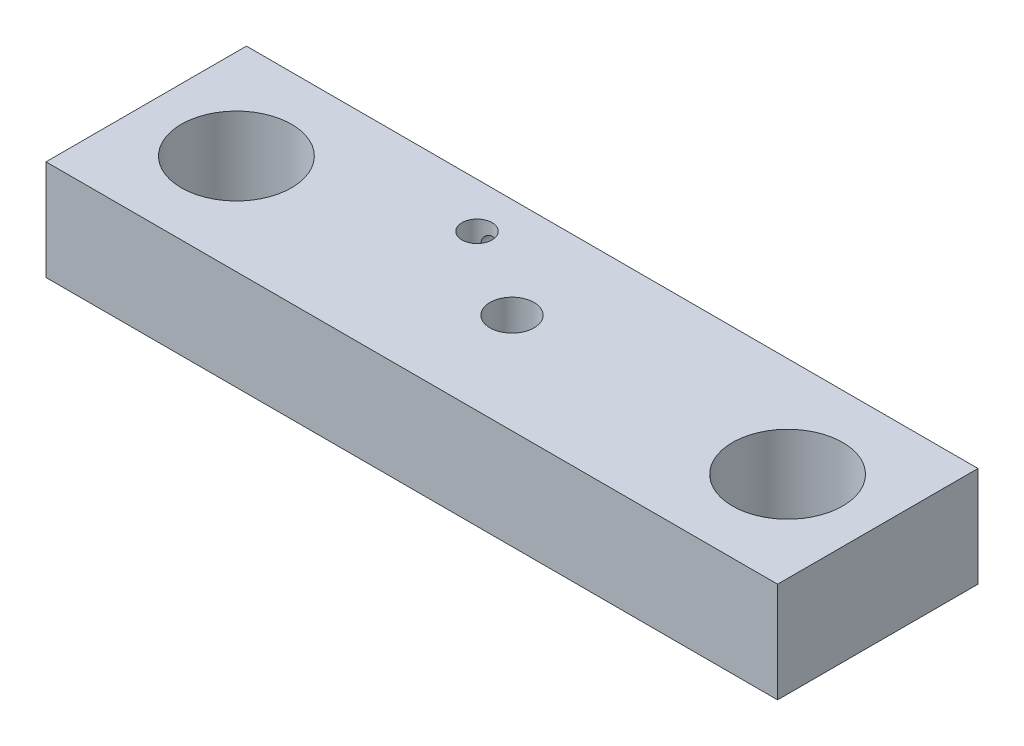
ISO-10303-21;
HEADER;
FILE_DESCRIPTION(('STEP AP214'),'2;1');
FILE_NAME('part.step','',(''),(''),'','','');
FILE_SCHEMA(('AUTOMOTIVE_DESIGN { 1 0 10303 214 1 1 1 1 }'));
ENDSEC;
DATA;
#1=APPLICATION_CONTEXT('core data for automotive mechanical design processes');
#2=APPLICATION_PROTOCOL_DEFINITION('international standard','automotive_design',2000,#1);
#3=PRODUCT_CONTEXT('',#1,'mechanical');
#4=PRODUCT('Part','Part','',(#3));
#5=PRODUCT_RELATED_PRODUCT_CATEGORY('part','',(#4));
#6=PRODUCT_DEFINITION_FORMATION('','',#4);
#7=PRODUCT_DEFINITION_CONTEXT('part definition',#1,'design');
#8=PRODUCT_DEFINITION('design','',#6,#7);
#9=PRODUCT_DEFINITION_SHAPE('','',#8);
#10=(LENGTH_UNIT() NAMED_UNIT(*) SI_UNIT(.MILLI.,.METRE.));
#11=(NAMED_UNIT(*) PLANE_ANGLE_UNIT() SI_UNIT($,.RADIAN.));
#12=(NAMED_UNIT(*) SI_UNIT($,.STERADIAN.) SOLID_ANGLE_UNIT());
#13=UNCERTAINTY_MEASURE_WITH_UNIT(LENGTH_MEASURE(1.E-05),#10,'distance_accuracy_value','');
#14=(GEOMETRIC_REPRESENTATION_CONTEXT(3) GLOBAL_UNCERTAINTY_ASSIGNED_CONTEXT((#13)) GLOBAL_UNIT_ASSIGNED_CONTEXT((#10,
#11,#12)) REPRESENTATION_CONTEXT('',''));
#15=CARTESIAN_POINT('',(0.,0.,0.));
#16=DIRECTION('',(0.,0.,1.));
#17=DIRECTION('',(1.,0.,0.));
#18=AXIS2_PLACEMENT_3D('',#15,#16,#17);
#19=CARTESIAN_POINT('',(-18.,16.,-20.));
#20=DIRECTION('',(0.,0.,-1.));
#21=DIRECTION('',(-1.,0.,0.));
#22=AXIS2_PLACEMENT_3D('',#19,#20,#21);
#23=CYLINDRICAL_SURFACE('',#22,1.65);
#24=CARTESIAN_POINT('',(-17.9823794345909,14.3500940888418,-13.9975346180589));
#25=CARTESIAN_POINT('',(-17.8965258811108,14.3510113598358,-13.9975342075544));
#26=CARTESIAN_POINT('',(-17.8107395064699,14.3586606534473,-13.9938160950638));
#27=CARTESIAN_POINT('',(-17.6419635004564,14.3870397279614,-13.9793631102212));
#28=CARTESIAN_POINT('',(-17.5589750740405,14.4077750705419,-13.968625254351));
#29=CARTESIAN_POINT('',(-17.3983944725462,14.4612631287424,-13.9412699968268));
#30=CARTESIAN_POINT('',(-17.3207832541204,14.4939705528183,-13.9246747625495));
#31=CARTESIAN_POINT('',(-17.1722580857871,14.5702032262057,-13.8870986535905));
#32=CARTESIAN_POINT('',(-17.1013455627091,14.6137307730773,-13.8661168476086));
#33=CARTESIAN_POINT('',(-16.9627439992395,14.7137640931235,-13.8199523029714));
#34=CARTESIAN_POINT('',(-16.8956169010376,14.7709591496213,-13.7945794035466));
#35=CARTESIAN_POINT('',(-16.7713714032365,14.8951478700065,-13.7430750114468));
#36=CARTESIAN_POINT('',(-16.714263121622,14.9621513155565,-13.7169427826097));
#37=CARTESIAN_POINT('',(-16.606217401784,15.1116488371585,-13.6640174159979));
#38=CARTESIAN_POINT('',(-16.5563854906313,15.1950104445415,-13.637398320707));
#39=CARTESIAN_POINT('',(-16.4717148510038,15.3704817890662,-13.5898823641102));
#40=CARTESIAN_POINT('',(-16.4368512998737,15.4625767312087,-13.5689760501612));
#41=CARTESIAN_POINT('',(-16.3905293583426,15.6290738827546,-13.5404767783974));
#42=CARTESIAN_POINT('',(-16.3753923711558,15.7021132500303,-13.5308591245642));
#43=CARTESIAN_POINT('',(-16.3551298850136,15.8500974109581,-13.5178932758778));
#44=CARTESIAN_POINT('',(-16.3499976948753,15.9250408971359,-13.5145408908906));
#45=CARTESIAN_POINT('',(-16.3500026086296,16.0848286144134,-13.5145480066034));
#46=CARTESIAN_POINT('',(-16.3565807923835,16.1696772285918,-13.518849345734));
#47=CARTESIAN_POINT('',(-16.3824919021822,16.3366360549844,-13.5353649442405));
#48=CARTESIAN_POINT('',(-16.4018377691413,16.4187433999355,-13.5475872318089));
#49=CARTESIAN_POINT('',(-16.4521409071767,16.5775246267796,-13.5780810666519));
#50=CARTESIAN_POINT('',(-16.4830304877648,16.6542271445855,-13.5963172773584));
#51=CARTESIAN_POINT('',(-16.5553322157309,16.8013498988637,-13.6367101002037));
#52=CARTESIAN_POINT('',(-16.5967476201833,16.8717681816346,-13.6588679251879));
#53=CARTESIAN_POINT('',(-16.6937196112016,17.011977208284,-13.7072523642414));
#54=CARTESIAN_POINT('',(-16.7502697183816,17.0810169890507,-13.7336646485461));
#55=CARTESIAN_POINT('',(-16.8738691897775,17.2092415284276,-13.7860311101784));
#56=CARTESIAN_POINT('',(-16.9409255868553,17.2684196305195,-13.8119849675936));
#57=CARTESIAN_POINT('',(-17.0903621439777,17.3800187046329,-13.8630250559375));
#58=CARTESIAN_POINT('',(-17.1735494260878,17.4314820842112,-13.8878638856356));
#59=CARTESIAN_POINT('',(-17.3489947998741,17.5193016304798,-13.9312947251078));
#60=CARTESIAN_POINT('',(-17.4412393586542,17.5556799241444,-13.9498958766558));
#61=CARTESIAN_POINT('',(-17.6084331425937,17.6046158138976,-13.9750273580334));
#62=CARTESIAN_POINT('',(-17.6820489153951,17.6208330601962,-13.9834020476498));
#63=CARTESIAN_POINT('',(-17.8312129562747,17.6430734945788,-13.9946556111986));
#64=CARTESIAN_POINT('',(-17.9067605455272,17.6491002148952,-13.9975363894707));
#65=CARTESIAN_POINT('',(-18.0679967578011,17.6508181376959,-13.9975326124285));
#66=CARTESIAN_POINT('',(-18.1537054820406,17.6450374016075,-13.9938353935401));
#67=CARTESIAN_POINT('',(-18.3226265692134,17.6204040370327,-13.9793851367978));
#68=CARTESIAN_POINT('',(-18.4058373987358,17.6015435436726,-13.9686278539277));
#69=CARTESIAN_POINT('',(-18.5671303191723,17.5517616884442,-13.9411277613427));
#70=CARTESIAN_POINT('',(-18.6452304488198,17.5208857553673,-13.9244075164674));
#71=CARTESIAN_POINT('',(-18.7949655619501,17.4482615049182,-13.886423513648));
#72=CARTESIAN_POINT('',(-18.8665993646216,17.4065112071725,-13.8651589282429));
#73=CARTESIAN_POINT('',(-19.0068532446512,17.3101424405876,-13.8182239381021));
#74=CARTESIAN_POINT('',(-19.0749352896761,17.2548409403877,-13.792352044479));
#75=CARTESIAN_POINT('',(-19.2013721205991,17.1343900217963,-13.7395703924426));
#76=CARTESIAN_POINT('',(-19.2597172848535,17.0692309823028,-13.7126596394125));
#77=CARTESIAN_POINT('',(-19.3710776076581,16.9230035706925,-13.6575642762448));
#78=CARTESIAN_POINT('',(-19.42293550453,16.8409893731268,-13.6295313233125));
#79=CARTESIAN_POINT('',(-19.5119347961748,16.6678301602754,-13.5788322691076));
#80=CARTESIAN_POINT('',(-19.5490945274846,16.5766967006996,-13.556159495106));
#81=CARTESIAN_POINT('',(-19.6015722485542,16.4049486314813,-13.523201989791));
#82=CARTESIAN_POINT('',(-19.6196457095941,16.3254690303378,-13.5114081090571));
#83=CARTESIAN_POINT('',(-19.6438535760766,16.1639923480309,-13.4954783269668));
#84=CARTESIAN_POINT('',(-19.6500004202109,16.0819979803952,-13.4913344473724));
#85=CARTESIAN_POINT('',(-19.6499995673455,15.915573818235,-13.4913360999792));
#86=CARTESIAN_POINT('',(-19.6434824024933,15.8311438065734,-13.4957307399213));
#87=CARTESIAN_POINT('',(-19.6178304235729,15.6650321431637,-13.5125941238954));
#88=CARTESIAN_POINT('',(-19.5986842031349,15.5833530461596,-13.5250701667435));
#89=CARTESIAN_POINT('',(-19.5489335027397,15.4254341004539,-13.5561970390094));
#90=CARTESIAN_POINT('',(-19.5183979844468,15.3491647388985,-13.5748106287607));
#91=CARTESIAN_POINT('',(-19.446961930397,15.2028571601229,-13.6160639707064));
#92=CARTESIAN_POINT('',(-19.4060580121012,15.1328209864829,-13.6387050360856));
#93=CARTESIAN_POINT('',(-19.310127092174,14.9930372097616,-13.6883132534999));
#94=CARTESIAN_POINT('',(-19.2540790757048,14.9240630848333,-13.7154857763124));
#95=CARTESIAN_POINT('',(-19.1315621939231,14.7958676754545,-13.7695131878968));
#96=CARTESIAN_POINT('',(-19.0650863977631,14.7366529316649,-13.7963678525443));
#97=CARTESIAN_POINT('',(-18.9163446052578,14.6244089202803,-13.8496374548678));
#98=CARTESIAN_POINT('',(-18.8331959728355,14.5724158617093,-13.8757953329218));
#99=CARTESIAN_POINT('',(-18.6576441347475,14.4835400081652,-13.921952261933));
#100=CARTESIAN_POINT('',(-18.5652520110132,14.4466393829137,-13.941958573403));
#101=CARTESIAN_POINT('',(-18.3913438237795,14.3949990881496,-13.9705899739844));
#102=CARTESIAN_POINT('',(-18.3108869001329,14.3774568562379,-13.9806197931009));
#103=CARTESIAN_POINT('',(-18.1477249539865,14.3545659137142,-13.994090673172));
#104=CARTESIAN_POINT('',(-18.0650210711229,14.3492111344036,-13.9975350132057));
#105=CARTESIAN_POINT('',(-17.9823794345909,14.3500940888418,-13.9975346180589));
#106=B_SPLINE_CURVE_WITH_KNOTS('',3,(#24,#25,#26,#27,#28,#29,#30,#31,#32,#33,#34,#35,#36,#37,
#38,#39,#40,#41,#42,#43,#44,#45,#46,#47,#48,#49,#50,#51,#52,#53,#54,#55,#56,#57,#58,#59,#60,#61,
#62,#63,#64,#65,#66,#67,#68,#69,#70,#71,#72,#73,#74,#75,#76,#77,#78,#79,#80,#81,#82,#83,#84,#85,
#86,#87,#88,#89,#90,#91,#92,#93,#94,#95,#96,#97,#98,#99,#100,#101,#102,#103,#104,#105),
.UNSPECIFIED.,.T.,.F.,(4,2,2,2,2,2,2,2,2,2,2,2,2,2,2,2,2,2,2,2,2,2,2,2,2,2,2,2,2,2,2,2,2,2,2,2,
2,2,2,2,4),(0.,0.257251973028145,0.514613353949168,0.771011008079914,1.02746315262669,
1.3016480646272,1.57610830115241,1.87670501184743,2.1768012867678,2.40155610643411,
2.62616055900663,2.880337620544,3.13477270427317,3.38773865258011,3.64078297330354,
3.91885552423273,4.19711501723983,4.49828623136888,4.79901410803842,5.02570052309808,
5.25230834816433,5.50887857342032,5.76560320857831,6.02136648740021,6.27717637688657,
6.55041869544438,6.82392944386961,7.1254425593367,7.42657832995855,7.67250104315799,
7.91816713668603,8.17110812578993,8.42427788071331,8.6759389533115,8.92768223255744,
9.20536775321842,9.483238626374,9.78611584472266,10.0886342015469,10.3363853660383,
10.5840131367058),.UNSPECIFIED.);
#107=CARTESIAN_POINT('',(-17.9823794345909,14.3500940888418,-13.9975346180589));
#108=VERTEX_POINT('',#107);
#109=EDGE_CURVE('E116',#108,#108,#106,.T.);
#110=ORIENTED_EDGE('',*,*,#109,.T.);
#111=EDGE_LOOP('',(#110));
#112=FACE_BOUND('',#111,.T.);
#113=CARTESIAN_POINT('',(-18.,16.,-20.));
#114=DIRECTION('',(0.,0.,-1.));
#115=DIRECTION('',(-1.,0.,0.));
#116=AXIS2_PLACEMENT_3D('',#113,#114,#115);
#117=CIRCLE('',#116,1.65);
#118=CARTESIAN_POINT('',(-19.65,16.,-20.));
#119=VERTEX_POINT('',#118);
#120=EDGE_CURVE('E102',#119,#119,#117,.T.);
#121=ORIENTED_EDGE('',*,*,#120,.T.);
#122=EDGE_LOOP('',(#121));
#123=FACE_BOUND('',#122,.T.);
#124=ADVANCED_FACE('F17',(#112,#123),#23,.F.);
#125=CARTESIAN_POINT('',(-18.,4.,-20.));
#126=DIRECTION('',(0.,0.,-1.));
#127=DIRECTION('',(-1.,0.,0.));
#128=AXIS2_PLACEMENT_3D('',#125,#126,#127);
#129=CYLINDRICAL_SURFACE('',#128,1.65);
#130=CARTESIAN_POINT('',(-17.9823794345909,2.35009408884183,-13.9975346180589));
#131=CARTESIAN_POINT('',(-17.8965258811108,2.35101135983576,-13.9975342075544));
#132=CARTESIAN_POINT('',(-17.8107395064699,2.35866065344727,-13.9938160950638));
#133=CARTESIAN_POINT('',(-17.6419635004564,2.38703972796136,-13.9793631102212));
#134=CARTESIAN_POINT('',(-17.5589750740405,2.40777507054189,-13.968625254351));
#135=CARTESIAN_POINT('',(-17.3983944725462,2.46126312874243,-13.9412699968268));
#136=CARTESIAN_POINT('',(-17.3207832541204,2.49397055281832,-13.9246747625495));
#137=CARTESIAN_POINT('',(-17.1722580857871,2.57020322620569,-13.8870986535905));
#138=CARTESIAN_POINT('',(-17.1013455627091,2.61373077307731,-13.8661168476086));
#139=CARTESIAN_POINT('',(-16.9627439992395,2.71376409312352,-13.8199523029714));
#140=CARTESIAN_POINT('',(-16.8956169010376,2.77095914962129,-13.7945794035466));
#141=CARTESIAN_POINT('',(-16.7713714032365,2.89514787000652,-13.7430750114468));
#142=CARTESIAN_POINT('',(-16.714263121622,2.96215131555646,-13.7169427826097));
#143=CARTESIAN_POINT('',(-16.606217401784,3.11164883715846,-13.6640174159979));
#144=CARTESIAN_POINT('',(-16.5563854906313,3.19501044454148,-13.637398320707));
#145=CARTESIAN_POINT('',(-16.4717148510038,3.37048178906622,-13.5898823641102));
#146=CARTESIAN_POINT('',(-16.4368512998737,3.46257673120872,-13.5689760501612));
#147=CARTESIAN_POINT('',(-16.3905293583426,3.62907388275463,-13.5404767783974));
#148=CARTESIAN_POINT('',(-16.3753923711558,3.70211325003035,-13.5308591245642));
#149=CARTESIAN_POINT('',(-16.3551298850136,3.85009741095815,-13.5178932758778));
#150=CARTESIAN_POINT('',(-16.3499976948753,3.92504089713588,-13.5145408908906));
#151=CARTESIAN_POINT('',(-16.3500026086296,4.08482861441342,-13.5145480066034));
#152=CARTESIAN_POINT('',(-16.3565807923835,4.16967722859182,-13.518849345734));
#153=CARTESIAN_POINT('',(-16.3824919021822,4.33663605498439,-13.5353649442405));
#154=CARTESIAN_POINT('',(-16.4018377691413,4.41874339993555,-13.5475872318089));
#155=CARTESIAN_POINT('',(-16.4521409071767,4.57752462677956,-13.5780810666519));
#156=CARTESIAN_POINT('',(-16.4830304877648,4.65422714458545,-13.5963172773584));
#157=CARTESIAN_POINT('',(-16.5553322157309,4.80134989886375,-13.6367101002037));
#158=CARTESIAN_POINT('',(-16.5967476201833,4.87176818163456,-13.6588679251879));
#159=CARTESIAN_POINT('',(-16.6937196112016,5.01197720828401,-13.7072523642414));
#160=CARTESIAN_POINT('',(-16.7502697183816,5.08101698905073,-13.7336646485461));
#161=CARTESIAN_POINT('',(-16.8738691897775,5.20924152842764,-13.7860311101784));
#162=CARTESIAN_POINT('',(-16.9409255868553,5.26841963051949,-13.8119849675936));
#163=CARTESIAN_POINT('',(-17.0903621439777,5.38001870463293,-13.8630250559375));
#164=CARTESIAN_POINT('',(-17.1735494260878,5.43148208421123,-13.8878638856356));
#165=CARTESIAN_POINT('',(-17.3489947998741,5.51930163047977,-13.9312947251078));
#166=CARTESIAN_POINT('',(-17.4412393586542,5.55567992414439,-13.9498958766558));
#167=CARTESIAN_POINT('',(-17.6084331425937,5.60461581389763,-13.9750273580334));
#168=CARTESIAN_POINT('',(-17.6820489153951,5.62083306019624,-13.9834020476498));
#169=CARTESIAN_POINT('',(-17.8312129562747,5.6430734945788,-13.9946556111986));
#170=CARTESIAN_POINT('',(-17.9067605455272,5.64910021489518,-13.9975363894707));
#171=CARTESIAN_POINT('',(-18.0679967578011,5.65081813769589,-13.9975326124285));
#172=CARTESIAN_POINT('',(-18.1537054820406,5.64503740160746,-13.9938353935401));
#173=CARTESIAN_POINT('',(-18.3226265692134,5.62040403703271,-13.9793851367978));
#174=CARTESIAN_POINT('',(-18.4058373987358,5.60154354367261,-13.9686278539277));
#175=CARTESIAN_POINT('',(-18.5671303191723,5.55176168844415,-13.9411277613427));
#176=CARTESIAN_POINT('',(-18.6452304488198,5.52088575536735,-13.9244075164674));
#177=CARTESIAN_POINT('',(-18.7949655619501,5.44826150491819,-13.886423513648));
#178=CARTESIAN_POINT('',(-18.8665993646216,5.40651120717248,-13.8651589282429));
#179=CARTESIAN_POINT('',(-19.0068532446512,5.31014244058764,-13.8182239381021));
#180=CARTESIAN_POINT('',(-19.0749352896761,5.25484094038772,-13.792352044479));
#181=CARTESIAN_POINT('',(-19.2013721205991,5.13439002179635,-13.7395703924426));
#182=CARTESIAN_POINT('',(-19.2597172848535,5.06923098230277,-13.7126596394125));
#183=CARTESIAN_POINT('',(-19.3710776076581,4.92300357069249,-13.6575642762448));
#184=CARTESIAN_POINT('',(-19.42293550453,4.84098937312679,-13.6295313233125));
#185=CARTESIAN_POINT('',(-19.5119347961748,4.66783016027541,-13.5788322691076));
#186=CARTESIAN_POINT('',(-19.5490945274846,4.5766967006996,-13.556159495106));
#187=CARTESIAN_POINT('',(-19.6015722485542,4.40494863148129,-13.523201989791));
#188=CARTESIAN_POINT('',(-19.6196457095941,4.32546903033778,-13.5114081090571));
#189=CARTESIAN_POINT('',(-19.6438535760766,4.16399234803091,-13.4954783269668));
#190=CARTESIAN_POINT('',(-19.6500004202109,4.08199798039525,-13.4913344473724));
#191=CARTESIAN_POINT('',(-19.6499995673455,3.915573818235,-13.4913360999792));
#192=CARTESIAN_POINT('',(-19.6434824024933,3.83114380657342,-13.4957307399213));
#193=CARTESIAN_POINT('',(-19.6178304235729,3.6650321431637,-13.5125941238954));
#194=CARTESIAN_POINT('',(-19.5986842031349,3.5833530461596,-13.5250701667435));
#195=CARTESIAN_POINT('',(-19.5489335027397,3.42543410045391,-13.5561970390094));
#196=CARTESIAN_POINT('',(-19.5183979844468,3.34916473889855,-13.5748106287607));
#197=CARTESIAN_POINT('',(-19.446961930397,3.20285716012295,-13.6160639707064));
#198=CARTESIAN_POINT('',(-19.4060580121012,3.13282098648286,-13.6387050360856));
#199=CARTESIAN_POINT('',(-19.310127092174,2.99303720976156,-13.6883132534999));
#200=CARTESIAN_POINT('',(-19.2540790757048,2.92406308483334,-13.7154857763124));
#201=CARTESIAN_POINT('',(-19.1315621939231,2.79586767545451,-13.7695131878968));
#202=CARTESIAN_POINT('',(-19.0650863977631,2.73665293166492,-13.7963678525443));
#203=CARTESIAN_POINT('',(-18.9163446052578,2.62440892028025,-13.8496374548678));
#204=CARTESIAN_POINT('',(-18.8331959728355,2.57241586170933,-13.8757953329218));
#205=CARTESIAN_POINT('',(-18.6576441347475,2.48354000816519,-13.921952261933));
#206=CARTESIAN_POINT('',(-18.5652520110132,2.44663938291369,-13.941958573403));
#207=CARTESIAN_POINT('',(-18.3913438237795,2.39499908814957,-13.9705899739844));
#208=CARTESIAN_POINT('',(-18.3108869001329,2.37745685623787,-13.9806197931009));
#209=CARTESIAN_POINT('',(-18.1477249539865,2.35456591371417,-13.994090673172));
#210=CARTESIAN_POINT('',(-18.0650210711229,2.34921113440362,-13.9975350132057));
#211=CARTESIAN_POINT('',(-17.9823794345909,2.35009408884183,-13.9975346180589));
#212=B_SPLINE_CURVE_WITH_KNOTS('',3,(#130,#131,#132,#133,#134,#135,#136,#137,#138,#139,#140,
#141,#142,#143,#144,#145,#146,#147,#148,#149,#150,#151,#152,#153,#154,#155,#156,#157,#158,#159,
#160,#161,#162,#163,#164,#165,#166,#167,#168,#169,#170,#171,#172,#173,#174,#175,#176,#177,#178,
#179,#180,#181,#182,#183,#184,#185,#186,#187,#188,#189,#190,#191,#192,#193,#194,#195,#196,#197,
#198,#199,#200,#201,#202,#203,#204,#205,#206,#207,#208,#209,#210,#211),.UNSPECIFIED.,.T.,.F.,(4,
2,2,2,2,2,2,2,2,2,2,2,2,2,2,2,2,2,2,2,2,2,2,2,2,2,2,2,2,2,2,2,2,2,2,2,2,2,2,2,4),(0.,
0.257251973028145,0.514613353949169,0.771011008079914,1.02746315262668,1.30164806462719,
1.57610830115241,1.87670501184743,2.1768012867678,2.40155610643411,2.62616055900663,
2.880337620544,3.13477270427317,3.38773865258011,3.64078297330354,3.91885552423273,
4.19711501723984,4.49828623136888,4.79901410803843,5.02570052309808,5.25230834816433,
5.50887857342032,5.76560320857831,6.02136648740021,6.27717637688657,6.55041869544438,
6.82392944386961,7.1254425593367,7.42657832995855,7.67250104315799,7.91816713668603,
8.17110812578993,8.42427788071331,8.6759389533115,8.92768223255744,9.20536775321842,
9.483238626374,9.78611584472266,10.0886342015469,10.3363853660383,10.5840131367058),.UNSPECIFIED.);
#213=CARTESIAN_POINT('',(-17.9823794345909,2.35009408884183,-13.9975346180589));
#214=VERTEX_POINT('',#213);
#215=EDGE_CURVE('E21',#214,#214,#212,.T.);
#216=ORIENTED_EDGE('',*,*,#215,.T.);
#217=EDGE_LOOP('',(#216));
#218=FACE_BOUND('',#217,.T.);
#219=CARTESIAN_POINT('',(-18.,4.,-20.));
#220=DIRECTION('',(0.,0.,-1.));
#221=DIRECTION('',(-1.,0.,0.));
#222=AXIS2_PLACEMENT_3D('',#219,#220,#221);
#223=CIRCLE('',#222,1.65);
#224=CARTESIAN_POINT('',(-19.65,4.,-20.));
#225=VERTEX_POINT('',#224);
#226=EDGE_CURVE('E71',#225,#225,#223,.T.);
#227=ORIENTED_EDGE('',*,*,#226,.T.);
#228=EDGE_LOOP('',(#227));
#229=FACE_BOUND('',#228,.T.);
#230=ADVANCED_FACE('F130',(#218,#229),#129,.F.);
#231=CARTESIAN_POINT('',(0.,20.,0.));
#232=DIRECTION('',(0.,1.,0.));
#233=DIRECTION('',(0.,0.,1.));
#234=AXIS2_PLACEMENT_3D('',#231,#232,#233);
#235=PLANE('',#234);
#236=DIRECTION('',(0.,0.,-1.));
#237=VECTOR('',#236,1.);
#238=CARTESIAN_POINT('',(-73.,20.,-20.));
#239=LINE('',#238,#237);
#240=CARTESIAN_POINT('',(-73.,20.,-20.));
#241=VERTEX_POINT('',#240);
#242=CARTESIAN_POINT('',(-73.,20.,20.));
#243=VERTEX_POINT('',#242);
#244=EDGE_CURVE('E59',#241,#243,#239,.F.);
#245=ORIENTED_EDGE('',*,*,#244,.T.);
#246=DIRECTION('',(-1.,0.,0.));
#247=VECTOR('',#246,1.);
#248=CARTESIAN_POINT('',(-73.,20.,20.));
#249=LINE('',#248,#247);
#250=CARTESIAN_POINT('',(73.,20.,20.));
#251=VERTEX_POINT('',#250);
#252=EDGE_CURVE('E297',#243,#251,#249,.F.);
#253=ORIENTED_EDGE('',*,*,#252,.T.);
#254=DIRECTION('',(0.,0.,1.));
#255=VECTOR('',#254,1.);
#256=CARTESIAN_POINT('',(73.,20.,-20.));
#257=LINE('',#256,#255);
#258=CARTESIAN_POINT('',(73.,20.,-20.));
#259=VERTEX_POINT('',#258);
#260=EDGE_CURVE('E65',#251,#259,#257,.F.);
#261=ORIENTED_EDGE('',*,*,#260,.T.);
#262=DIRECTION('',(1.,0.,0.));
#263=VECTOR('',#262,1.);
#264=CARTESIAN_POINT('',(-73.,20.,-20.));
#265=LINE('',#264,#263);
#266=EDGE_CURVE('E62',#259,#241,#265,.F.);
#267=ORIENTED_EDGE('',*,*,#266,.T.);
#268=EDGE_LOOP('',(#245,#253,#261,#267));
#269=FACE_BOUND('',#268,.T.);
#270=CARTESIAN_POINT('',(-55.,20.,0.));
#271=DIRECTION('',(0.,1.,0.));
#272=DIRECTION('',(0.,0.,1.));
#273=AXIS2_PLACEMENT_3D('',#270,#271,#272);
#274=CIRCLE('',#273,11.);
#275=CARTESIAN_POINT('',(-55.,20.,11.));
#276=VERTEX_POINT('',#275);
#277=EDGE_CURVE('E105',#276,#276,#274,.F.);
#278=ORIENTED_EDGE('',*,*,#277,.T.);
#279=EDGE_LOOP('',(#278));
#280=FACE_BOUND('',#279,.T.);
#281=CARTESIAN_POINT('',(55.,20.,0.));
#282=DIRECTION('',(0.,1.,0.));
#283=DIRECTION('',(0.,0.,1.));
#284=AXIS2_PLACEMENT_3D('',#281,#282,#283);
#285=CIRCLE('',#284,11.);
#286=CARTESIAN_POINT('',(55.,20.,11.));
#287=VERTEX_POINT('',#286);
#288=EDGE_CURVE('E108',#287,#287,#285,.F.);
#289=ORIENTED_EDGE('',*,*,#288,.T.);
#290=EDGE_LOOP('',(#289));
#291=FACE_BOUND('',#290,.T.);
#292=CARTESIAN_POINT('',(0.,20.,0.));
#293=DIRECTION('',(0.,1.,0.));
#294=DIRECTION('',(0.,0.,1.));
#295=AXIS2_PLACEMENT_3D('',#292,#293,#294);
#296=CIRCLE('',#295,4.4);
#297=CARTESIAN_POINT('',(0.,20.,4.4));
#298=VERTEX_POINT('',#297);
#299=EDGE_CURVE('E111',#298,#298,#296,.F.);
#300=ORIENTED_EDGE('',*,*,#299,.T.);
#301=EDGE_LOOP('',(#300));
#302=FACE_BOUND('',#301,.T.);
#303=CARTESIAN_POINT('',(-17.9823794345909,20.,-10.9975346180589));
#304=DIRECTION('',(0.,-1.,0.));
#305=DIRECTION('',(0.,0.,-1.));
#306=AXIS2_PLACEMENT_3D('',#303,#304,#305);
#307=CIRCLE('',#306,3.);
#308=CARTESIAN_POINT('',(-17.9823794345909,20.,-13.9975346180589));
#309=VERTEX_POINT('',#308);
#310=EDGE_CURVE('E114',#309,#309,#307,.T.);
#311=ORIENTED_EDGE('',*,*,#310,.T.);
#312=EDGE_LOOP('',(#311));
#313=FACE_BOUND('',#312,.T.);
#314=ADVANCED_FACE('F63',(#269,#280,#291,#302,#313),#235,.T.);
#315=CARTESIAN_POINT('',(-17.9823794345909,20.,-10.9975346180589));
#316=DIRECTION('',(0.,-1.,0.));
#317=DIRECTION('',(0.,0.,-1.));
#318=AXIS2_PLACEMENT_3D('',#315,#316,#317);
#319=CYLINDRICAL_SURFACE('',#318,3.);
#320=ORIENTED_EDGE('',*,*,#215,.F.);
#321=EDGE_LOOP('',(#320));
#322=FACE_BOUND('',#321,.T.);
#323=ORIENTED_EDGE('',*,*,#109,.F.);
#324=EDGE_LOOP('',(#323));
#325=FACE_BOUND('',#324,.T.);
#326=ORIENTED_EDGE('',*,*,#310,.F.);
#327=EDGE_LOOP('',(#326));
#328=FACE_BOUND('',#327,.T.);
#329=CARTESIAN_POINT('',(-17.9823794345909,0.,-10.9975346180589));
#330=DIRECTION('',(0.,-1.,0.));
#331=DIRECTION('',(0.,0.,-1.));
#332=AXIS2_PLACEMENT_3D('',#329,#330,#331);
#333=CIRCLE('',#332,3.);
#334=CARTESIAN_POINT('',(-17.9823794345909,0.,-13.9975346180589));
#335=VERTEX_POINT('',#334);
#336=EDGE_CURVE('E96',#335,#335,#333,.T.);
#337=ORIENTED_EDGE('',*,*,#336,.T.);
#338=EDGE_LOOP('',(#337));
#339=FACE_BOUND('',#338,.T.);
#340=ADVANCED_FACE('F120',(#322,#325,#328,#339),#319,.F.);
#341=CARTESIAN_POINT('',(0.,20.,0.));
#342=DIRECTION('',(0.,1.,0.));
#343=DIRECTION('',(0.,0.,1.));
#344=AXIS2_PLACEMENT_3D('',#341,#342,#343);
#345=CYLINDRICAL_SURFACE('',#344,4.4);
#346=CARTESIAN_POINT('',(0.,0.,0.));
#347=DIRECTION('',(0.,1.,0.));
#348=DIRECTION('',(0.,0.,1.));
#349=AXIS2_PLACEMENT_3D('',#346,#347,#348);
#350=CIRCLE('',#349,4.4);
#351=CARTESIAN_POINT('',(0.,0.,4.4));
#352=VERTEX_POINT('',#351);
#353=EDGE_CURVE('E93',#352,#352,#350,.F.);
#354=ORIENTED_EDGE('',*,*,#353,.T.);
#355=EDGE_LOOP('',(#354));
#356=FACE_BOUND('',#355,.T.);
#357=ORIENTED_EDGE('',*,*,#299,.F.);
#358=EDGE_LOOP('',(#357));
#359=FACE_BOUND('',#358,.T.);
#360=ADVANCED_FACE('F125',(#356,#359),#345,.F.);
#361=CARTESIAN_POINT('',(55.,0.,0.));
#362=DIRECTION('',(0.,1.,0.));
#363=DIRECTION('',(0.,0.,1.));
#364=AXIS2_PLACEMENT_3D('',#361,#362,#363);
#365=CYLINDRICAL_SURFACE('',#364,11.);
#366=CARTESIAN_POINT('',(55.,0.,0.));
#367=DIRECTION('',(0.,1.,0.));
#368=DIRECTION('',(0.,0.,1.));
#369=AXIS2_PLACEMENT_3D('',#366,#367,#368);
#370=CIRCLE('',#369,11.);
#371=CARTESIAN_POINT('',(55.,0.,11.));
#372=VERTEX_POINT('',#371);
#373=EDGE_CURVE('E90',#372,#372,#370,.F.);
#374=ORIENTED_EDGE('',*,*,#373,.T.);
#375=EDGE_LOOP('',(#374));
#376=FACE_BOUND('',#375,.T.);
#377=ORIENTED_EDGE('',*,*,#288,.F.);
#378=EDGE_LOOP('',(#377));
#379=FACE_BOUND('',#378,.T.);
#380=ADVANCED_FACE('F163',(#376,#379),#365,.F.);
#381=CARTESIAN_POINT('',(-55.,0.,0.));
#382=DIRECTION('',(0.,1.,0.));
#383=DIRECTION('',(0.,0.,1.));
#384=AXIS2_PLACEMENT_3D('',#381,#382,#383);
#385=CYLINDRICAL_SURFACE('',#384,11.);
#386=CARTESIAN_POINT('',(-55.,0.,0.));
#387=DIRECTION('',(0.,1.,0.));
#388=DIRECTION('',(0.,0.,1.));
#389=AXIS2_PLACEMENT_3D('',#386,#387,#388);
#390=CIRCLE('',#389,11.);
#391=CARTESIAN_POINT('',(-55.,0.,11.));
#392=VERTEX_POINT('',#391);
#393=EDGE_CURVE('E87',#392,#392,#390,.F.);
#394=ORIENTED_EDGE('',*,*,#393,.T.);
#395=EDGE_LOOP('',(#394));
#396=FACE_BOUND('',#395,.T.);
#397=ORIENTED_EDGE('',*,*,#277,.F.);
#398=EDGE_LOOP('',(#397));
#399=FACE_BOUND('',#398,.T.);
#400=ADVANCED_FACE('F161',(#396,#399),#385,.F.);
#401=CARTESIAN_POINT('',(-73.,20.,-20.));
#402=DIRECTION('',(0.,0.,1.));
#403=DIRECTION('',(1.,0.,0.));
#404=AXIS2_PLACEMENT_3D('',#401,#402,#403);
#405=PLANE('',#404);
#406=DIRECTION('',(0.,1.,0.));
#407=VECTOR('',#406,1.);
#408=CARTESIAN_POINT('',(-73.,20.,-20.));
#409=LINE('',#408,#407);
#410=CARTESIAN_POINT('',(-73.,0.,-20.));
#411=VERTEX_POINT('',#410);
#412=EDGE_CURVE('E70',#411,#241,#409,.T.);
#413=ORIENTED_EDGE('',*,*,#412,.T.);
#414=ORIENTED_EDGE('',*,*,#266,.F.);
#415=DIRECTION('',(0.,1.,0.));
#416=VECTOR('',#415,1.);
#417=CARTESIAN_POINT('',(73.,20.,-20.));
#418=LINE('',#417,#416);
#419=CARTESIAN_POINT('',(73.,0.,-20.));
#420=VERTEX_POINT('',#419);
#421=EDGE_CURVE('E99',#259,#420,#418,.F.);
#422=ORIENTED_EDGE('',*,*,#421,.T.);
#423=DIRECTION('',(1.,0.,0.));
#424=VECTOR('',#423,1.);
#425=CARTESIAN_POINT('',(0.,0.,-20.));
#426=LINE('',#425,#424);
#427=EDGE_CURVE('E83',#420,#411,#426,.F.);
#428=ORIENTED_EDGE('',*,*,#427,.T.);
#429=EDGE_LOOP('',(#413,#414,#422,#428));
#430=FACE_BOUND('',#429,.T.);
#431=ORIENTED_EDGE('',*,*,#226,.F.);
#432=EDGE_LOOP('',(#431));
#433=FACE_BOUND('',#432,.T.);
#434=ORIENTED_EDGE('',*,*,#120,.F.);
#435=EDGE_LOOP('',(#434));
#436=FACE_BOUND('',#435,.T.);
#437=ADVANCED_FACE('F81',(#430,#433,#436),#405,.F.);
#438=CARTESIAN_POINT('',(-73.,20.,-20.));
#439=DIRECTION('',(1.,0.,0.));
#440=DIRECTION('',(0.,0.,-1.));
#441=AXIS2_PLACEMENT_3D('',#438,#439,#440);
#442=PLANE('',#441);
#443=DIRECTION('',(0.,1.,0.));
#444=VECTOR('',#443,1.);
#445=CARTESIAN_POINT('',(-73.,20.,20.));
#446=LINE('',#445,#444);
#447=CARTESIAN_POINT('',(-73.,0.,20.));
#448=VERTEX_POINT('',#447);
#449=EDGE_CURVE('E78',#448,#243,#446,.T.);
#450=ORIENTED_EDGE('',*,*,#449,.T.);
#451=ORIENTED_EDGE('',*,*,#244,.F.);
#452=ORIENTED_EDGE('',*,*,#412,.F.);
#453=DIRECTION('',(0.,0.,1.));
#454=VECTOR('',#453,1.);
#455=CARTESIAN_POINT('',(-73.,0.,0.));
#456=LINE('',#455,#454);
#457=EDGE_CURVE('E304',#411,#448,#456,.T.);
#458=ORIENTED_EDGE('',*,*,#457,.T.);
#459=EDGE_LOOP('',(#450,#451,#452,#458));
#460=FACE_BOUND('',#459,.T.);
#461=ADVANCED_FACE('F75',(#460),#442,.F.);
#462=CARTESIAN_POINT('',(-73.,20.,20.));
#463=DIRECTION('',(0.,0.,-1.));
#464=DIRECTION('',(-1.,0.,0.));
#465=AXIS2_PLACEMENT_3D('',#462,#463,#464);
#466=PLANE('',#465);
#467=DIRECTION('',(0.,1.,0.));
#468=VECTOR('',#467,1.);
#469=CARTESIAN_POINT('',(73.,20.,20.));
#470=LINE('',#469,#468);
#471=CARTESIAN_POINT('',(73.,0.,20.));
#472=VERTEX_POINT('',#471);
#473=EDGE_CURVE('E38',#472,#251,#470,.T.);
#474=ORIENTED_EDGE('',*,*,#473,.T.);
#475=ORIENTED_EDGE('',*,*,#252,.F.);
#476=ORIENTED_EDGE('',*,*,#449,.F.);
#477=DIRECTION('',(1.,0.,0.));
#478=VECTOR('',#477,1.);
#479=CARTESIAN_POINT('',(0.,0.,20.));
#480=LINE('',#479,#478);
#481=EDGE_CURVE('E30',#448,#472,#480,.T.);
#482=ORIENTED_EDGE('',*,*,#481,.T.);
#483=EDGE_LOOP('',(#474,#475,#476,#482));
#484=FACE_BOUND('',#483,.T.);
#485=ADVANCED_FACE('F149',(#484),#466,.F.);
#486=CARTESIAN_POINT('',(73.,20.,-20.));
#487=DIRECTION('',(-1.,0.,0.));
#488=DIRECTION('',(0.,0.,1.));
#489=AXIS2_PLACEMENT_3D('',#486,#487,#488);
#490=PLANE('',#489);
#491=ORIENTED_EDGE('',*,*,#421,.F.);
#492=ORIENTED_EDGE('',*,*,#260,.F.);
#493=ORIENTED_EDGE('',*,*,#473,.F.);
#494=DIRECTION('',(0.,0.,1.));
#495=VECTOR('',#494,1.);
#496=CARTESIAN_POINT('',(73.,0.,0.));
#497=LINE('',#496,#495);
#498=EDGE_CURVE('E11',#472,#420,#497,.F.);
#499=ORIENTED_EDGE('',*,*,#498,.T.);
#500=EDGE_LOOP('',(#491,#492,#493,#499));
#501=FACE_BOUND('',#500,.T.);
#502=ADVANCED_FACE('F143',(#501),#490,.F.);
#503=CARTESIAN_POINT('',(0.,0.,0.));
#504=DIRECTION('',(0.,1.,0.));
#505=DIRECTION('',(0.,0.,1.));
#506=AXIS2_PLACEMENT_3D('',#503,#504,#505);
#507=PLANE('',#506);
#508=ORIENTED_EDGE('',*,*,#481,.F.);
#509=ORIENTED_EDGE('',*,*,#457,.F.);
#510=ORIENTED_EDGE('',*,*,#427,.F.);
#511=ORIENTED_EDGE('',*,*,#498,.F.);
#512=EDGE_LOOP('',(#508,#509,#510,#511));
#513=FACE_BOUND('',#512,.T.);
#514=ORIENTED_EDGE('',*,*,#393,.F.);
#515=EDGE_LOOP('',(#514));
#516=FACE_BOUND('',#515,.T.);
#517=ORIENTED_EDGE('',*,*,#373,.F.);
#518=EDGE_LOOP('',(#517));
#519=FACE_BOUND('',#518,.T.);
#520=ORIENTED_EDGE('',*,*,#353,.F.);
#521=EDGE_LOOP('',(#520));
#522=FACE_BOUND('',#521,.T.);
#523=ORIENTED_EDGE('',*,*,#336,.F.);
#524=EDGE_LOOP('',(#523));
#525=FACE_BOUND('',#524,.T.);
#526=ADVANCED_FACE('F141',(#513,#516,#519,#522,#525),#507,.F.);
#527=CLOSED_SHELL('',(#124,#230,#314,#340,#360,#380,#400,#437,#461,#485,#502,#526));
#528=MANIFOLD_SOLID_BREP('B1',#527);
#529=ADVANCED_BREP_SHAPE_REPRESENTATION('',(#18,#528),#14);
#530=SHAPE_DEFINITION_REPRESENTATION(#9,#529);
ENDSEC;
END-ISO-10303-21;
